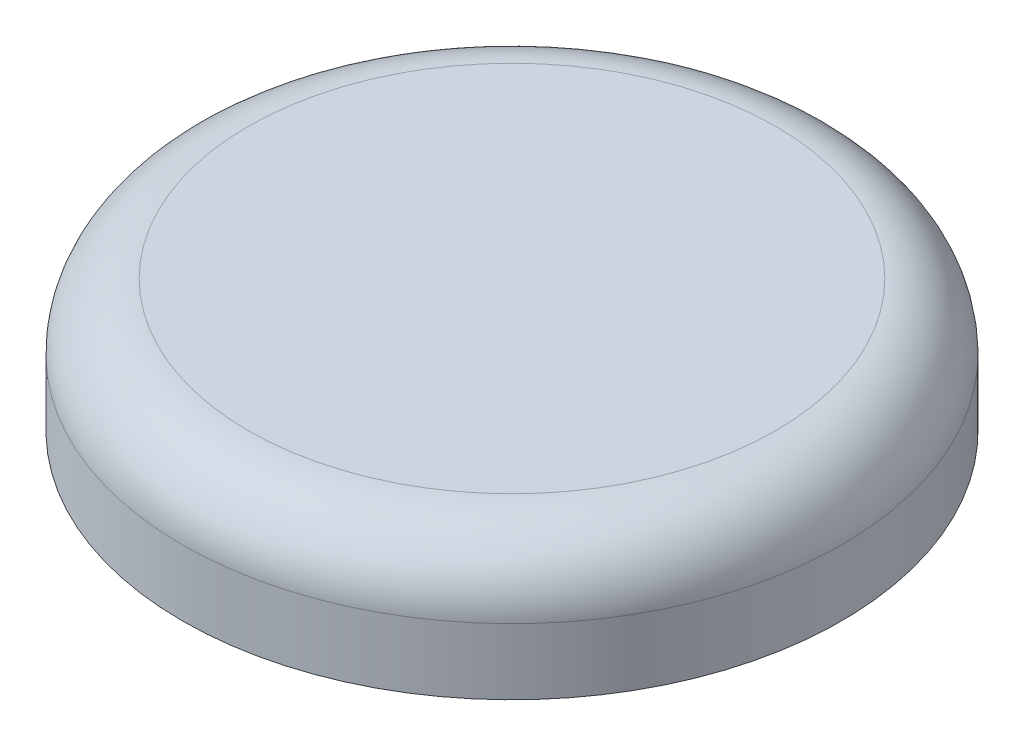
from build123d import *

# Parameters (mm, degrees)
SKIZZE1_R               = 25
LINEAR_AUSTRAGEN1_DEPTH = 5
VERRUNDUNG1_R           = 5
WANDUNG1_T              = -1


with BuildPart() as part:
    # Skizze1 → Linear austragen1 (new, symmetric)
    with BuildSketch(Plane(origin=(0, 0, 0), x_dir=(1, 0, 0), z_dir=(0, 1, 0))):
        with Locations(Location((0, 0, 0), (0, 0, 270))):
            Circle(SKIZZE1_R)
    extrude(amount=LINEAR_AUSTRAGEN1_DEPTH, both=True)

    # Verrundung1
    verrundung1_edges = [part.edges().sort_by_distance(p)[0] for p in [
        (0, 5, -25),
    ]]
    fillet(verrundung1_edges, radius=VERRUNDUNG1_R)

    # Wandung1
    wandung1_openings = [part.faces().sort_by_distance(p)[0] for p in [
        (0, -5, 0),
    ]]
    offset(amount=WANDUNG1_T, openings=wandung1_openings, kind=Kind.INTERSECTION)


solid = part.part
